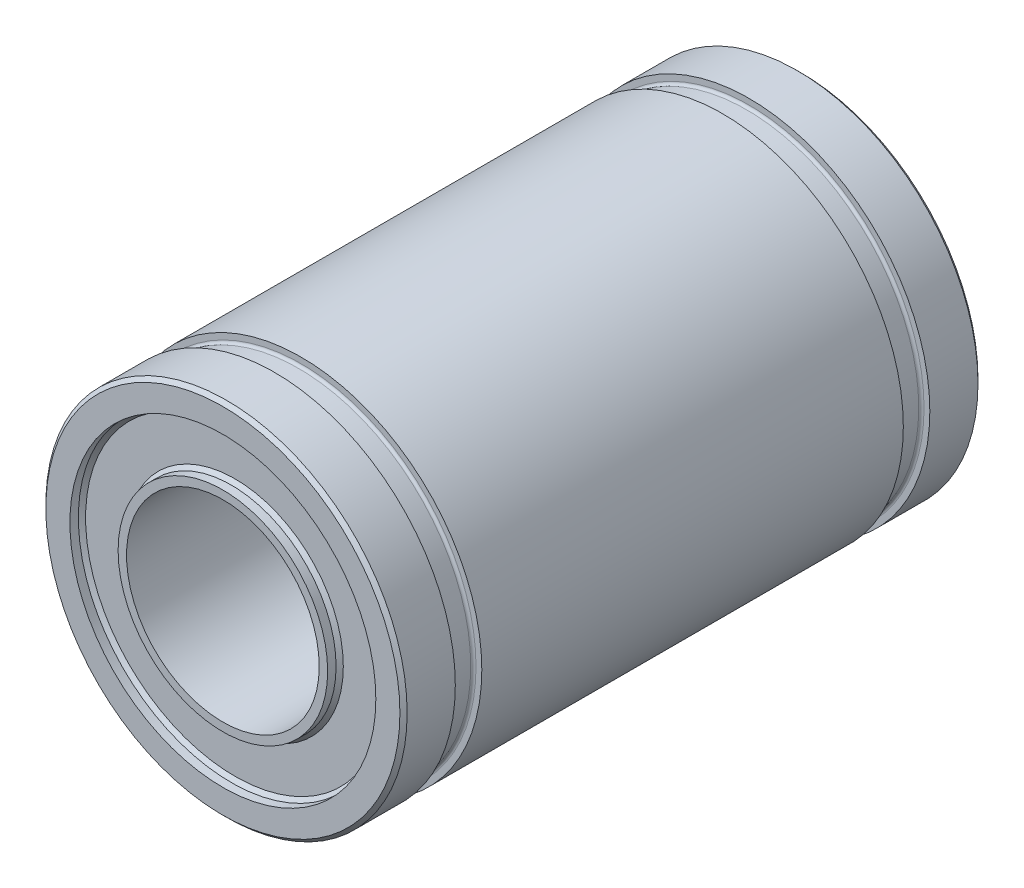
from build123d import *

# Parameters (mm, degrees)
SKETCH1_R           = 7.5
SKETCH1_R_2         = 4
BOSS_EXTRUDE1_DEPTH = 24
SKETCH2_R           = 6.35
SKETCH2_R_2         = 4.35
CUT_EXTRUDE1_DEPTH  = 0.5
CUT_EXTRUDE2_START  = -0.5
SKETCH3_R           = 6.35
SKETCH3_R_2         = 4.35
CUT_EXTRUDE2_DEPTH  = 0.5
CHAMFER1_SIZE       = 0.15


with BuildPart() as part:
    # Sketch1 → Boss-Extrude1 (new body)
    with BuildSketch(Plane.XY):
        Circle(SKETCH1_R)
        Circle(SKETCH1_R_2, mode=Mode.SUBTRACT)
    extrude(amount=-BOSS_EXTRUDE1_DEPTH)

    # Sketch2 → Cut-Extrude1 (cut)
    with BuildSketch(Plane.XY):
        Circle(SKETCH2_R)
        Circle(SKETCH2_R_2, mode=Mode.SUBTRACT)
    extrude(amount=-CUT_EXTRUDE1_DEPTH, mode=Mode.SUBTRACT)

    # Sketch3 → Cut-Extrude2 (cut)
    with BuildSketch(Plane(origin=(0, 0, -24), x_dir=(-1, 0, 0), z_dir=(0, 0, -1)).offset(CUT_EXTRUDE2_START)):
        with Locations(Location((0, 0, 0), (0, 0, 180))):
            Circle(SKETCH3_R)
        with Locations(Location((0, 0, 0), (0, 0, 180))):
            Circle(SKETCH3_R_2, mode=Mode.SUBTRACT)
    extrude(amount=CUT_EXTRUDE2_DEPTH, mode=Mode.SUBTRACT)

    # Groove Sketch → Retaining Ring Groove (revolve, cut)
    with BuildSketch(Plane(origin=(10.524041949, 3.020841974, -25.315160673), x_dir=(-0.24395257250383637, -0.07002463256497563, -0.9672557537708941), z_dir=(-0.27590077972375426, 0.9611861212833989, 0)), mode=Mode.PRIVATE) as retaining_ring_groove_sk:
        with BuildLine():
            Line((-16.721138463, 23.21299415), (-16.66022558, 23.445135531))
            Line((-16.66022558, 23.445135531), (-17.724206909, 23.724319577))
            Line((-17.724206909, 23.724319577), (-17.785119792, 23.492178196))
            ThreePointArc((-17.785119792, 23.492178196), (-17.773697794, 23.408766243), (-17.706640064, 23.357861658))
            Line((-17.706640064, 23.357861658), (-16.855455, 23.134514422))
            ThreePointArc((-16.855455, 23.134514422), (-16.772043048, 23.14593642), (-16.721138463, 23.21299415))
        make_face()
    revolve(retaining_ring_groove_sk.sketch.rotate(Axis((0, 0, -38.025873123), (0, 0, 1)), 163.984298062), axis=Axis((0, 0, -38.025873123), (0, 0, 1)), mode=Mode.SUBTRACT)

    # Groove Sketch1 → Retaining Ring Groove1 (revolve, cut)
    with BuildSketch(Plane(origin=(10.524041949, 3.020841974, -25.315160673), x_dir=(-0.24395257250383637, -0.07002463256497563, -0.9672557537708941), z_dir=(-0.27590077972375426, 0.9611861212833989, 0)), mode=Mode.PRIVATE) as retaining_ring_groove1_sk:
        with BuildLine():
            Line((1.269818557, 18.492245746), (1.33073144, 18.724387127))
            Line((1.33073144, 18.724387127), (0.266750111, 19.003571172))
            Line((0.266750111, 19.003571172), (0.205837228, 18.771429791))
            ThreePointArc((0.205837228, 18.771429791), (0.217259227, 18.688017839), (0.284316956, 18.637113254))
            Line((0.284316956, 18.637113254), (1.13550202, 18.413766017))
            ThreePointArc((1.13550202, 18.413766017), (1.218913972, 18.425188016), (1.269818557, 18.492245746))
        make_face()
    revolve(retaining_ring_groove1_sk.sketch.rotate(Axis((0, 0, -38.025873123), (0, 0, 1)), 163.984298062), axis=Axis((0, 0, -38.025873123), (0, 0, 1)), mode=Mode.SUBTRACT)

    # Chamfer1
    chamfer1_edges = [part.edges().sort_by_distance(p)[0] for p in [
        (-6.35, 0, -0.5),
        (-4.35, 0, -0.5),
        (-6.35, 0, -23.5),
        (-7.5, 0, 0),
        (-4.35, 0, -23.5),
        (-7.5, 0, -24),
    ]]
    chamfer(chamfer1_edges, length=CHAMFER1_SIZE)


solid = part.part
